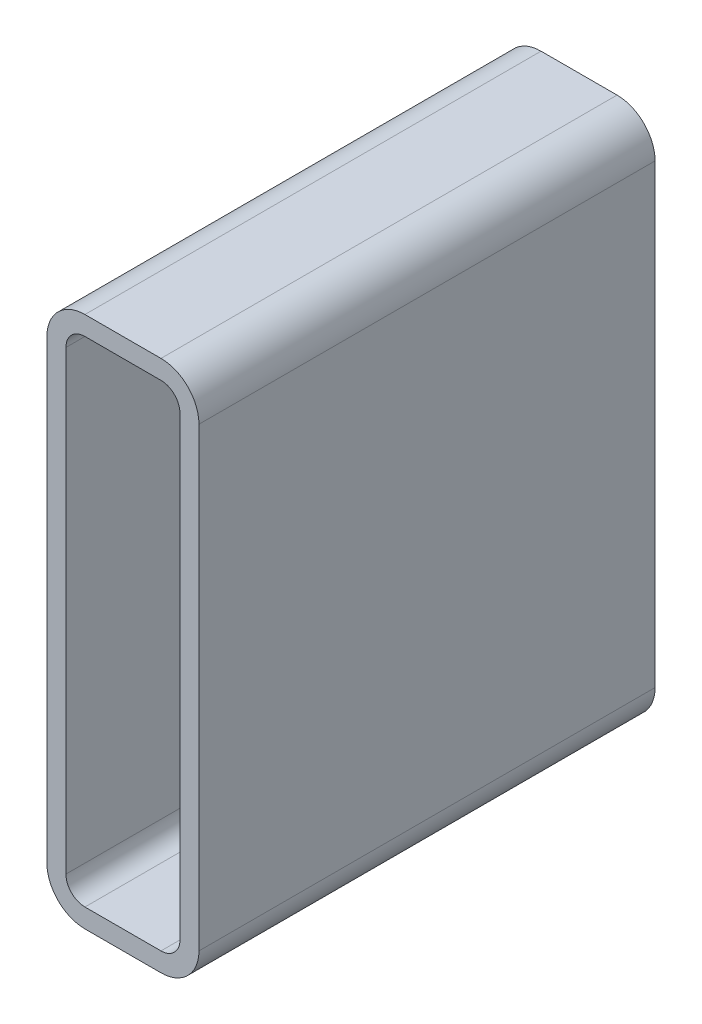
ISO-10303-21;
HEADER;
FILE_DESCRIPTION(('STEP AP214'),'2;1');
FILE_NAME('part.step','',(''),(''),'','','');
FILE_SCHEMA(('AUTOMOTIVE_DESIGN { 1 0 10303 214 1 1 1 1 }'));
ENDSEC;
DATA;
#1=APPLICATION_CONTEXT('core data for automotive mechanical design processes');
#2=APPLICATION_PROTOCOL_DEFINITION('international standard','automotive_design',2000,#1);
#3=PRODUCT_CONTEXT('',#1,'mechanical');
#4=PRODUCT('Part','Part','',(#3));
#5=PRODUCT_RELATED_PRODUCT_CATEGORY('part','',(#4));
#6=PRODUCT_DEFINITION_FORMATION('','',#4);
#7=PRODUCT_DEFINITION_CONTEXT('part definition',#1,'design');
#8=PRODUCT_DEFINITION('design','',#6,#7);
#9=PRODUCT_DEFINITION_SHAPE('','',#8);
#10=(LENGTH_UNIT() NAMED_UNIT(*) SI_UNIT(.MILLI.,.METRE.));
#11=(NAMED_UNIT(*) PLANE_ANGLE_UNIT() SI_UNIT($,.RADIAN.));
#12=(NAMED_UNIT(*) SI_UNIT($,.STERADIAN.) SOLID_ANGLE_UNIT());
#13=UNCERTAINTY_MEASURE_WITH_UNIT(LENGTH_MEASURE(1.E-05),#10,'distance_accuracy_value','');
#14=(GEOMETRIC_REPRESENTATION_CONTEXT(3) GLOBAL_UNCERTAINTY_ASSIGNED_CONTEXT((#13)) GLOBAL_UNIT_ASSIGNED_CONTEXT((#10,
#11,#12)) REPRESENTATION_CONTEXT('',''));
#15=CARTESIAN_POINT('',(0.,0.,0.));
#16=DIRECTION('',(0.,0.,1.));
#17=DIRECTION('',(1.,0.,0.));
#18=AXIS2_PLACEMENT_3D('',#15,#16,#17);
#19=CARTESIAN_POINT('',(27.0751778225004,332.028679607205,304.8));
#20=DIRECTION('',(0.,0.,1.));
#21=DIRECTION('',(1.,0.,0.));
#22=AXIS2_PLACEMENT_3D('',#19,#20,#21);
#23=PLANE('',#22);
#24=CARTESIAN_POINT('',(27.0751778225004,332.028679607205,304.8));
#25=DIRECTION('',(0.,0.,1.));
#26=DIRECTION('',(1.,0.,0.));
#27=AXIS2_PLACEMENT_3D('',#24,#25,#26);
#28=CIRCLE('',#27,25.4);
#29=CARTESIAN_POINT('',(27.0751778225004,357.428679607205,304.8));
#30=VERTEX_POINT('',#29);
#31=CARTESIAN_POINT('',(1.67517782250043,332.028679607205,304.8));
#32=VERTEX_POINT('',#31);
#33=EDGE_CURVE('E211',#30,#32,#28,.T.);
#34=ORIENTED_EDGE('',*,*,#33,.T.);
#35=DIRECTION('',(0.,-1.,0.));
#36=VECTOR('',#35,1.);
#37=CARTESIAN_POINT('',(1.67517782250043,27.2286796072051,304.8));
#38=LINE('',#37,#36);
#39=CARTESIAN_POINT('',(1.67517782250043,27.2286796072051,304.8));
#40=VERTEX_POINT('',#39);
#41=EDGE_CURVE('E214',#32,#40,#38,.T.);
#42=ORIENTED_EDGE('',*,*,#41,.T.);
#43=CARTESIAN_POINT('',(27.0751778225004,27.2286796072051,304.8));
#44=DIRECTION('',(0.,0.,1.));
#45=DIRECTION('',(1.,0.,0.));
#46=AXIS2_PLACEMENT_3D('',#43,#44,#45);
#47=CIRCLE('',#46,25.4);
#48=CARTESIAN_POINT('',(27.0751778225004,1.82867960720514,304.8));
#49=VERTEX_POINT('',#48);
#50=EDGE_CURVE('E217',#40,#49,#47,.T.);
#51=ORIENTED_EDGE('',*,*,#50,.T.);
#52=DIRECTION('',(1.,0.,0.));
#53=VECTOR('',#52,1.);
#54=CARTESIAN_POINT('',(77.8751778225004,1.82867960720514,304.8));
#55=LINE('',#54,#53);
#56=CARTESIAN_POINT('',(77.8751778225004,1.82867960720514,304.8));
#57=VERTEX_POINT('',#56);
#58=EDGE_CURVE('E219',#49,#57,#55,.T.);
#59=ORIENTED_EDGE('',*,*,#58,.T.);
#60=CARTESIAN_POINT('',(77.8751778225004,27.2286796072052,304.8));
#61=DIRECTION('',(0.,0.,1.));
#62=DIRECTION('',(1.,0.,0.));
#63=AXIS2_PLACEMENT_3D('',#60,#61,#62);
#64=CIRCLE('',#63,25.4);
#65=CARTESIAN_POINT('',(103.2751778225,27.2286796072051,304.8));
#66=VERTEX_POINT('',#65);
#67=EDGE_CURVE('E221',#57,#66,#64,.T.);
#68=ORIENTED_EDGE('',*,*,#67,.T.);
#69=DIRECTION('',(0.,1.,0.));
#70=VECTOR('',#69,1.);
#71=CARTESIAN_POINT('',(103.2751778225,332.028679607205,304.8));
#72=LINE('',#71,#70);
#73=CARTESIAN_POINT('',(103.2751778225,332.028679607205,304.8));
#74=VERTEX_POINT('',#73);
#75=EDGE_CURVE('E223',#66,#74,#72,.T.);
#76=ORIENTED_EDGE('',*,*,#75,.T.);
#77=CARTESIAN_POINT('',(77.8751778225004,332.028679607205,304.8));
#78=DIRECTION('',(0.,0.,1.));
#79=DIRECTION('',(1.,0.,0.));
#80=AXIS2_PLACEMENT_3D('',#77,#78,#79);
#81=CIRCLE('',#80,25.4);
#82=CARTESIAN_POINT('',(77.8751778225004,357.428679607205,304.8));
#83=VERTEX_POINT('',#82);
#84=EDGE_CURVE('E225',#74,#83,#81,.T.);
#85=ORIENTED_EDGE('',*,*,#84,.T.);
#86=DIRECTION('',(-1.,0.,0.));
#87=VECTOR('',#86,1.);
#88=CARTESIAN_POINT('',(27.0751778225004,357.428679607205,304.8));
#89=LINE('',#88,#87);
#90=EDGE_CURVE('E227',#83,#30,#89,.T.);
#91=ORIENTED_EDGE('',*,*,#90,.T.);
#92=EDGE_LOOP('',(#34,#42,#51,#59,#68,#76,#85,#91));
#93=FACE_BOUND('',#92,.T.);
#94=DIRECTION('',(0.,-1.,0.));
#95=VECTOR('',#94,1.);
#96=CARTESIAN_POINT('',(14.3751778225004,27.2286796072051,304.8));
#97=LINE('',#96,#95);
#98=CARTESIAN_POINT('',(14.3751778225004,332.028679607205,304.8));
#99=VERTEX_POINT('',#98);
#100=CARTESIAN_POINT('',(14.3751778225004,27.2286796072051,304.8));
#101=VERTEX_POINT('',#100);
#102=EDGE_CURVE('E154',#99,#101,#97,.T.);
#103=ORIENTED_EDGE('',*,*,#102,.F.);
#104=CARTESIAN_POINT('',(27.0751778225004,332.028679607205,304.8));
#105=DIRECTION('',(0.,0.,1.));
#106=DIRECTION('',(1.,0.,0.));
#107=AXIS2_PLACEMENT_3D('',#104,#105,#106);
#108=CIRCLE('',#107,12.7);
#109=CARTESIAN_POINT('',(27.0751778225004,344.728679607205,304.8));
#110=VERTEX_POINT('',#109);
#111=EDGE_CURVE('E146',#110,#99,#108,.T.);
#112=ORIENTED_EDGE('',*,*,#111,.F.);
#113=DIRECTION('',(-1.,0.,0.));
#114=VECTOR('',#113,1.);
#115=CARTESIAN_POINT('',(27.0751778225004,344.728679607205,304.8));
#116=LINE('',#115,#114);
#117=CARTESIAN_POINT('',(77.8751778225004,344.728679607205,304.8));
#118=VERTEX_POINT('',#117);
#119=EDGE_CURVE('E179',#118,#110,#116,.T.);
#120=ORIENTED_EDGE('',*,*,#119,.F.);
#121=CARTESIAN_POINT('',(77.8751778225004,332.028679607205,304.8));
#122=DIRECTION('',(0.,0.,1.));
#123=DIRECTION('',(1.,0.,0.));
#124=AXIS2_PLACEMENT_3D('',#121,#122,#123);
#125=CIRCLE('',#124,12.7);
#126=CARTESIAN_POINT('',(90.5751778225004,332.028679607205,304.8));
#127=VERTEX_POINT('',#126);
#128=EDGE_CURVE('E177',#127,#118,#125,.T.);
#129=ORIENTED_EDGE('',*,*,#128,.F.);
#130=DIRECTION('',(0.,1.,0.));
#131=VECTOR('',#130,1.);
#132=CARTESIAN_POINT('',(90.5751778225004,332.028679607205,304.8));
#133=LINE('',#132,#131);
#134=CARTESIAN_POINT('',(90.5751778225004,27.2286796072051,304.8));
#135=VERTEX_POINT('',#134);
#136=EDGE_CURVE('E175',#135,#127,#133,.T.);
#137=ORIENTED_EDGE('',*,*,#136,.F.);
#138=CARTESIAN_POINT('',(77.8751778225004,27.2286796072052,304.8));
#139=DIRECTION('',(0.,0.,1.));
#140=DIRECTION('',(1.,0.,0.));
#141=AXIS2_PLACEMENT_3D('',#138,#139,#140);
#142=CIRCLE('',#141,12.7);
#143=CARTESIAN_POINT('',(77.8751778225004,14.5286796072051,304.8));
#144=VERTEX_POINT('',#143);
#145=EDGE_CURVE('E173',#144,#135,#142,.T.);
#146=ORIENTED_EDGE('',*,*,#145,.F.);
#147=DIRECTION('',(1.,0.,0.));
#148=VECTOR('',#147,1.);
#149=CARTESIAN_POINT('',(77.8751778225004,14.5286796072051,304.8));
#150=LINE('',#149,#148);
#151=CARTESIAN_POINT('',(27.0751778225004,14.5286796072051,304.8));
#152=VERTEX_POINT('',#151);
#153=EDGE_CURVE('E169',#152,#144,#150,.T.);
#154=ORIENTED_EDGE('',*,*,#153,.F.);
#155=CARTESIAN_POINT('',(27.0751778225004,27.2286796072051,304.8));
#156=DIRECTION('',(0.,0.,1.));
#157=DIRECTION('',(1.,0.,0.));
#158=AXIS2_PLACEMENT_3D('',#155,#156,#157);
#159=CIRCLE('',#158,12.7);
#160=EDGE_CURVE('E167',#101,#152,#159,.T.);
#161=ORIENTED_EDGE('',*,*,#160,.F.);
#162=EDGE_LOOP('',(#103,#112,#120,#129,#137,#146,#154,#161));
#163=FACE_BOUND('',#162,.T.);
#164=ADVANCED_FACE('F33',(#93,#163),#23,.T.);
#165=CARTESIAN_POINT('',(27.0751778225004,332.028679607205,0.));
#166=DIRECTION('',(0.,0.,1.));
#167=DIRECTION('',(1.,0.,0.));
#168=AXIS2_PLACEMENT_3D('',#165,#166,#167);
#169=PLANE('',#168);
#170=CARTESIAN_POINT('',(27.0751778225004,332.028679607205,0.));
#171=DIRECTION('',(0.,0.,1.));
#172=DIRECTION('',(1.,0.,0.));
#173=AXIS2_PLACEMENT_3D('',#170,#171,#172);
#174=CIRCLE('',#173,25.4);
#175=CARTESIAN_POINT('',(27.0751778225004,357.428679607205,0.));
#176=VERTEX_POINT('',#175);
#177=CARTESIAN_POINT('',(1.67517782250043,332.028679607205,0.));
#178=VERTEX_POINT('',#177);
#179=EDGE_CURVE('E162',#176,#178,#174,.T.);
#180=ORIENTED_EDGE('',*,*,#179,.F.);
#181=DIRECTION('',(-1.,0.,0.));
#182=VECTOR('',#181,1.);
#183=CARTESIAN_POINT('',(27.0751778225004,357.428679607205,0.));
#184=LINE('',#183,#182);
#185=CARTESIAN_POINT('',(77.8751778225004,357.428679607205,0.));
#186=VERTEX_POINT('',#185);
#187=EDGE_CURVE('E215',#186,#176,#184,.T.);
#188=ORIENTED_EDGE('',*,*,#187,.F.);
#189=CARTESIAN_POINT('',(77.8751778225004,332.028679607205,0.));
#190=DIRECTION('',(0.,0.,1.));
#191=DIRECTION('',(1.,0.,0.));
#192=AXIS2_PLACEMENT_3D('',#189,#190,#191);
#193=CIRCLE('',#192,25.4);
#194=CARTESIAN_POINT('',(103.2751778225,332.028679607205,0.));
#195=VERTEX_POINT('',#194);
#196=EDGE_CURVE('E242',#195,#186,#193,.T.);
#197=ORIENTED_EDGE('',*,*,#196,.F.);
#198=DIRECTION('',(0.,1.,0.));
#199=VECTOR('',#198,1.);
#200=CARTESIAN_POINT('',(103.2751778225,332.028679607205,0.));
#201=LINE('',#200,#199);
#202=CARTESIAN_POINT('',(103.2751778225,27.2286796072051,0.));
#203=VERTEX_POINT('',#202);
#204=EDGE_CURVE('E240',#203,#195,#201,.T.);
#205=ORIENTED_EDGE('',*,*,#204,.F.);
#206=CARTESIAN_POINT('',(77.8751778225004,27.2286796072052,0.));
#207=DIRECTION('',(0.,0.,1.));
#208=DIRECTION('',(1.,0.,0.));
#209=AXIS2_PLACEMENT_3D('',#206,#207,#208);
#210=CIRCLE('',#209,25.4);
#211=CARTESIAN_POINT('',(77.8751778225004,1.82867960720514,0.));
#212=VERTEX_POINT('',#211);
#213=EDGE_CURVE('E238',#212,#203,#210,.T.);
#214=ORIENTED_EDGE('',*,*,#213,.F.);
#215=DIRECTION('',(1.,0.,0.));
#216=VECTOR('',#215,1.);
#217=CARTESIAN_POINT('',(77.8751778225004,1.82867960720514,0.));
#218=LINE('',#217,#216);
#219=CARTESIAN_POINT('',(27.0751778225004,1.82867960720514,0.));
#220=VERTEX_POINT('',#219);
#221=EDGE_CURVE('E236',#220,#212,#218,.T.);
#222=ORIENTED_EDGE('',*,*,#221,.F.);
#223=CARTESIAN_POINT('',(27.0751778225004,27.2286796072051,0.));
#224=DIRECTION('',(0.,0.,1.));
#225=DIRECTION('',(1.,0.,0.));
#226=AXIS2_PLACEMENT_3D('',#223,#224,#225);
#227=CIRCLE('',#226,25.4);
#228=CARTESIAN_POINT('',(1.67517782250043,27.2286796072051,0.));
#229=VERTEX_POINT('',#228);
#230=EDGE_CURVE('E234',#229,#220,#227,.T.);
#231=ORIENTED_EDGE('',*,*,#230,.F.);
#232=DIRECTION('',(0.,-1.,0.));
#233=VECTOR('',#232,1.);
#234=CARTESIAN_POINT('',(1.67517782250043,27.2286796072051,0.));
#235=LINE('',#234,#233);
#236=EDGE_CURVE('E232',#178,#229,#235,.T.);
#237=ORIENTED_EDGE('',*,*,#236,.F.);
#238=EDGE_LOOP('',(#180,#188,#197,#205,#214,#222,#231,#237));
#239=FACE_BOUND('',#238,.T.);
#240=CARTESIAN_POINT('',(27.0751778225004,332.028679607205,0.));
#241=DIRECTION('',(0.,0.,1.));
#242=DIRECTION('',(1.,0.,0.));
#243=AXIS2_PLACEMENT_3D('',#240,#241,#242);
#244=CIRCLE('',#243,12.7);
#245=CARTESIAN_POINT('',(27.0751778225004,344.728679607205,0.));
#246=VERTEX_POINT('',#245);
#247=CARTESIAN_POINT('',(14.3751778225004,332.028679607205,0.));
#248=VERTEX_POINT('',#247);
#249=EDGE_CURVE('E56',#246,#248,#244,.T.);
#250=ORIENTED_EDGE('',*,*,#249,.T.);
#251=DIRECTION('',(0.,-1.,0.));
#252=VECTOR('',#251,1.);
#253=CARTESIAN_POINT('',(14.3751778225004,27.2286796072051,0.));
#254=LINE('',#253,#252);
#255=CARTESIAN_POINT('',(14.3751778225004,27.2286796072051,0.));
#256=VERTEX_POINT('',#255);
#257=EDGE_CURVE('E161',#248,#256,#254,.T.);
#258=ORIENTED_EDGE('',*,*,#257,.T.);
#259=CARTESIAN_POINT('',(27.0751778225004,27.2286796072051,0.));
#260=DIRECTION('',(0.,0.,1.));
#261=DIRECTION('',(1.,0.,0.));
#262=AXIS2_PLACEMENT_3D('',#259,#260,#261);
#263=CIRCLE('',#262,12.7);
#264=CARTESIAN_POINT('',(27.0751778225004,14.5286796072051,0.));
#265=VERTEX_POINT('',#264);
#266=EDGE_CURVE('E183',#256,#265,#263,.T.);
#267=ORIENTED_EDGE('',*,*,#266,.T.);
#268=DIRECTION('',(1.,0.,0.));
#269=VECTOR('',#268,1.);
#270=CARTESIAN_POINT('',(77.8751778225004,14.5286796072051,0.));
#271=LINE('',#270,#269);
#272=CARTESIAN_POINT('',(77.8751778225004,14.5286796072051,0.));
#273=VERTEX_POINT('',#272);
#274=EDGE_CURVE('E186',#265,#273,#271,.T.);
#275=ORIENTED_EDGE('',*,*,#274,.T.);
#276=CARTESIAN_POINT('',(77.8751778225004,27.2286796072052,0.));
#277=DIRECTION('',(0.,0.,1.));
#278=DIRECTION('',(1.,0.,0.));
#279=AXIS2_PLACEMENT_3D('',#276,#277,#278);
#280=CIRCLE('',#279,12.7);
#281=CARTESIAN_POINT('',(90.5751778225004,27.2286796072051,0.));
#282=VERTEX_POINT('',#281);
#283=EDGE_CURVE('E189',#273,#282,#280,.T.);
#284=ORIENTED_EDGE('',*,*,#283,.T.);
#285=DIRECTION('',(0.,1.,0.));
#286=VECTOR('',#285,1.);
#287=CARTESIAN_POINT('',(90.5751778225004,332.028679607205,0.));
#288=LINE('',#287,#286);
#289=CARTESIAN_POINT('',(90.5751778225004,332.028679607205,0.));
#290=VERTEX_POINT('',#289);
#291=EDGE_CURVE('E192',#282,#290,#288,.T.);
#292=ORIENTED_EDGE('',*,*,#291,.T.);
#293=CARTESIAN_POINT('',(77.8751778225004,332.028679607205,0.));
#294=DIRECTION('',(0.,0.,1.));
#295=DIRECTION('',(1.,0.,0.));
#296=AXIS2_PLACEMENT_3D('',#293,#294,#295);
#297=CIRCLE('',#296,12.7);
#298=CARTESIAN_POINT('',(77.8751778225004,344.728679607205,0.));
#299=VERTEX_POINT('',#298);
#300=EDGE_CURVE('E195',#290,#299,#297,.T.);
#301=ORIENTED_EDGE('',*,*,#300,.T.);
#302=DIRECTION('',(-1.,0.,0.));
#303=VECTOR('',#302,1.);
#304=CARTESIAN_POINT('',(27.0751778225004,344.728679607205,0.));
#305=LINE('',#304,#303);
#306=EDGE_CURVE('E155',#299,#246,#305,.T.);
#307=ORIENTED_EDGE('',*,*,#306,.T.);
#308=EDGE_LOOP('',(#250,#258,#267,#275,#284,#292,#301,#307));
#309=FACE_BOUND('',#308,.T.);
#310=ADVANCED_FACE('F272',(#239,#309),#169,.F.);
#311=CARTESIAN_POINT('',(27.0751778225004,332.028679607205,304.8));
#312=DIRECTION('',(0.,0.,-1.));
#313=DIRECTION('',(-1.,0.,0.));
#314=AXIS2_PLACEMENT_3D('',#311,#312,#313);
#315=CYLINDRICAL_SURFACE('',#314,25.4);
#316=ORIENTED_EDGE('',*,*,#179,.T.);
#317=DIRECTION('',(0.,0.,-1.));
#318=VECTOR('',#317,1.);
#319=CARTESIAN_POINT('',(1.67517782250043,332.028679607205,304.8));
#320=LINE('',#319,#318);
#321=EDGE_CURVE('E11',#32,#178,#320,.T.);
#322=ORIENTED_EDGE('',*,*,#321,.F.);
#323=ORIENTED_EDGE('',*,*,#33,.F.);
#324=DIRECTION('',(0.,0.,-1.));
#325=VECTOR('',#324,1.);
#326=CARTESIAN_POINT('',(27.0751778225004,357.428679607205,304.8));
#327=LINE('',#326,#325);
#328=EDGE_CURVE('E229',#30,#176,#327,.T.);
#329=ORIENTED_EDGE('',*,*,#328,.T.);
#330=EDGE_LOOP('',(#316,#322,#323,#329));
#331=FACE_BOUND('',#330,.T.);
#332=ADVANCED_FACE('F35',(#331),#315,.T.);
#333=CARTESIAN_POINT('',(1.67517782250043,27.2286796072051,304.8));
#334=DIRECTION('',(1.,0.,0.));
#335=DIRECTION('',(0.,0.,-1.));
#336=AXIS2_PLACEMENT_3D('',#333,#334,#335);
#337=PLANE('',#336);
#338=ORIENTED_EDGE('',*,*,#236,.T.);
#339=DIRECTION('',(0.,0.,-1.));
#340=VECTOR('',#339,1.);
#341=CARTESIAN_POINT('',(1.67517782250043,27.2286796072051,304.8));
#342=LINE('',#341,#340);
#343=EDGE_CURVE('E41',#40,#229,#342,.T.);
#344=ORIENTED_EDGE('',*,*,#343,.F.);
#345=ORIENTED_EDGE('',*,*,#41,.F.);
#346=ORIENTED_EDGE('',*,*,#321,.T.);
#347=EDGE_LOOP('',(#338,#344,#345,#346));
#348=FACE_BOUND('',#347,.T.);
#349=ADVANCED_FACE('F289',(#348),#337,.F.);
#350=CARTESIAN_POINT('',(27.0751778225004,27.2286796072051,304.8));
#351=DIRECTION('',(0.,0.,-1.));
#352=DIRECTION('',(-1.,0.,0.));
#353=AXIS2_PLACEMENT_3D('',#350,#351,#352);
#354=CYLINDRICAL_SURFACE('',#353,25.4);
#355=ORIENTED_EDGE('',*,*,#230,.T.);
#356=DIRECTION('',(0.,0.,-1.));
#357=VECTOR('',#356,1.);
#358=CARTESIAN_POINT('',(27.0751778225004,1.82867960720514,304.8));
#359=LINE('',#358,#357);
#360=EDGE_CURVE('E259',#49,#220,#359,.T.);
#361=ORIENTED_EDGE('',*,*,#360,.F.);
#362=ORIENTED_EDGE('',*,*,#50,.F.);
#363=ORIENTED_EDGE('',*,*,#343,.T.);
#364=EDGE_LOOP('',(#355,#361,#362,#363));
#365=FACE_BOUND('',#364,.T.);
#366=ADVANCED_FACE('F266',(#365),#354,.T.);
#367=CARTESIAN_POINT('',(77.8751778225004,1.82867960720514,304.8));
#368=DIRECTION('',(0.,1.,0.));
#369=DIRECTION('',(0.,0.,1.));
#370=AXIS2_PLACEMENT_3D('',#367,#368,#369);
#371=PLANE('',#370);
#372=ORIENTED_EDGE('',*,*,#221,.T.);
#373=DIRECTION('',(0.,0.,-1.));
#374=VECTOR('',#373,1.);
#375=CARTESIAN_POINT('',(77.8751778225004,1.82867960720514,304.8));
#376=LINE('',#375,#374);
#377=EDGE_CURVE('E256',#57,#212,#376,.T.);
#378=ORIENTED_EDGE('',*,*,#377,.F.);
#379=ORIENTED_EDGE('',*,*,#58,.F.);
#380=ORIENTED_EDGE('',*,*,#360,.T.);
#381=EDGE_LOOP('',(#372,#378,#379,#380));
#382=FACE_BOUND('',#381,.T.);
#383=ADVANCED_FACE('F278',(#382),#371,.F.);
#384=CARTESIAN_POINT('',(77.8751778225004,27.2286796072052,304.8));
#385=DIRECTION('',(0.,0.,-1.));
#386=DIRECTION('',(-1.,0.,0.));
#387=AXIS2_PLACEMENT_3D('',#384,#385,#386);
#388=CYLINDRICAL_SURFACE('',#387,25.4);
#389=ORIENTED_EDGE('',*,*,#213,.T.);
#390=DIRECTION('',(0.,0.,-1.));
#391=VECTOR('',#390,1.);
#392=CARTESIAN_POINT('',(103.2751778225,27.2286796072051,304.8));
#393=LINE('',#392,#391);
#394=EDGE_CURVE('E253',#66,#203,#393,.T.);
#395=ORIENTED_EDGE('',*,*,#394,.F.);
#396=ORIENTED_EDGE('',*,*,#67,.F.);
#397=ORIENTED_EDGE('',*,*,#377,.T.);
#398=EDGE_LOOP('',(#389,#395,#396,#397));
#399=FACE_BOUND('',#398,.T.);
#400=ADVANCED_FACE('F282',(#399),#388,.T.);
#401=CARTESIAN_POINT('',(103.2751778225,332.028679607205,304.8));
#402=DIRECTION('',(-1.,0.,0.));
#403=DIRECTION('',(0.,0.,1.));
#404=AXIS2_PLACEMENT_3D('',#401,#402,#403);
#405=PLANE('',#404);
#406=ORIENTED_EDGE('',*,*,#204,.T.);
#407=DIRECTION('',(0.,0.,-1.));
#408=VECTOR('',#407,1.);
#409=CARTESIAN_POINT('',(103.2751778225,332.028679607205,304.8));
#410=LINE('',#409,#408);
#411=EDGE_CURVE('E250',#74,#195,#410,.T.);
#412=ORIENTED_EDGE('',*,*,#411,.F.);
#413=ORIENTED_EDGE('',*,*,#75,.F.);
#414=ORIENTED_EDGE('',*,*,#394,.T.);
#415=EDGE_LOOP('',(#406,#412,#413,#414));
#416=FACE_BOUND('',#415,.T.);
#417=ADVANCED_FACE('F302',(#416),#405,.F.);
#418=CARTESIAN_POINT('',(77.8751778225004,332.028679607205,304.8));
#419=DIRECTION('',(0.,0.,-1.));
#420=DIRECTION('',(-1.,0.,0.));
#421=AXIS2_PLACEMENT_3D('',#418,#419,#420);
#422=CYLINDRICAL_SURFACE('',#421,25.4);
#423=ORIENTED_EDGE('',*,*,#196,.T.);
#424=DIRECTION('',(0.,0.,-1.));
#425=VECTOR('',#424,1.);
#426=CARTESIAN_POINT('',(77.8751778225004,357.428679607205,304.8));
#427=LINE('',#426,#425);
#428=EDGE_CURVE('E247',#83,#186,#427,.T.);
#429=ORIENTED_EDGE('',*,*,#428,.F.);
#430=ORIENTED_EDGE('',*,*,#84,.F.);
#431=ORIENTED_EDGE('',*,*,#411,.T.);
#432=EDGE_LOOP('',(#423,#429,#430,#431));
#433=FACE_BOUND('',#432,.T.);
#434=ADVANCED_FACE('F300',(#433),#422,.T.);
#435=CARTESIAN_POINT('',(27.0751778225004,357.428679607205,304.8));
#436=DIRECTION('',(0.,-1.,0.));
#437=DIRECTION('',(0.,0.,-1.));
#438=AXIS2_PLACEMENT_3D('',#435,#436,#437);
#439=PLANE('',#438);
#440=ORIENTED_EDGE('',*,*,#187,.T.);
#441=ORIENTED_EDGE('',*,*,#328,.F.);
#442=ORIENTED_EDGE('',*,*,#90,.F.);
#443=ORIENTED_EDGE('',*,*,#428,.T.);
#444=EDGE_LOOP('',(#440,#441,#442,#443));
#445=FACE_BOUND('',#444,.T.);
#446=ADVANCED_FACE('F295',(#445),#439,.F.);
#447=CARTESIAN_POINT('',(27.0751778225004,332.028679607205,304.8));
#448=DIRECTION('',(0.,0.,-1.));
#449=DIRECTION('',(-1.,0.,0.));
#450=AXIS2_PLACEMENT_3D('',#447,#448,#449);
#451=CYLINDRICAL_SURFACE('',#450,12.7);
#452=ORIENTED_EDGE('',*,*,#249,.F.);
#453=DIRECTION('',(0.,0.,-1.));
#454=VECTOR('',#453,1.);
#455=CARTESIAN_POINT('',(27.0751778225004,344.728679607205,304.8));
#456=LINE('',#455,#454);
#457=EDGE_CURVE('E150',#110,#246,#456,.T.);
#458=ORIENTED_EDGE('',*,*,#457,.F.);
#459=ORIENTED_EDGE('',*,*,#111,.T.);
#460=DIRECTION('',(0.,0.,-1.));
#461=VECTOR('',#460,1.);
#462=CARTESIAN_POINT('',(14.3751778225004,332.028679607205,304.8));
#463=LINE('',#462,#461);
#464=EDGE_CURVE('E149',#99,#248,#463,.T.);
#465=ORIENTED_EDGE('',*,*,#464,.T.);
#466=EDGE_LOOP('',(#452,#458,#459,#465));
#467=FACE_BOUND('',#466,.T.);
#468=ADVANCED_FACE('F148',(#467),#451,.F.);
#469=CARTESIAN_POINT('',(14.3751778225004,27.2286796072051,304.8));
#470=DIRECTION('',(1.,0.,0.));
#471=DIRECTION('',(0.,0.,-1.));
#472=AXIS2_PLACEMENT_3D('',#469,#470,#471);
#473=PLANE('',#472);
#474=ORIENTED_EDGE('',*,*,#257,.F.);
#475=ORIENTED_EDGE('',*,*,#464,.F.);
#476=ORIENTED_EDGE('',*,*,#102,.T.);
#477=DIRECTION('',(0.,0.,-1.));
#478=VECTOR('',#477,1.);
#479=CARTESIAN_POINT('',(14.3751778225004,27.2286796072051,304.8));
#480=LINE('',#479,#478);
#481=EDGE_CURVE('E163',#101,#256,#480,.T.);
#482=ORIENTED_EDGE('',*,*,#481,.T.);
#483=EDGE_LOOP('',(#474,#475,#476,#482));
#484=FACE_BOUND('',#483,.T.);
#485=ADVANCED_FACE('F158',(#484),#473,.T.);
#486=CARTESIAN_POINT('',(27.0751778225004,27.2286796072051,304.8));
#487=DIRECTION('',(0.,0.,-1.));
#488=DIRECTION('',(-1.,0.,0.));
#489=AXIS2_PLACEMENT_3D('',#486,#487,#488);
#490=CYLINDRICAL_SURFACE('',#489,12.7);
#491=ORIENTED_EDGE('',*,*,#266,.F.);
#492=ORIENTED_EDGE('',*,*,#481,.F.);
#493=ORIENTED_EDGE('',*,*,#160,.T.);
#494=DIRECTION('',(0.,0.,-1.));
#495=VECTOR('',#494,1.);
#496=CARTESIAN_POINT('',(27.0751778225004,14.5286796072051,304.8));
#497=LINE('',#496,#495);
#498=EDGE_CURVE('E208',#152,#265,#497,.T.);
#499=ORIENTED_EDGE('',*,*,#498,.T.);
#500=EDGE_LOOP('',(#491,#492,#493,#499));
#501=FACE_BOUND('',#500,.T.);
#502=ADVANCED_FACE('F327',(#501),#490,.F.);
#503=CARTESIAN_POINT('',(77.8751778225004,14.5286796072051,304.8));
#504=DIRECTION('',(0.,1.,0.));
#505=DIRECTION('',(0.,0.,1.));
#506=AXIS2_PLACEMENT_3D('',#503,#504,#505);
#507=PLANE('',#506);
#508=ORIENTED_EDGE('',*,*,#274,.F.);
#509=ORIENTED_EDGE('',*,*,#498,.F.);
#510=ORIENTED_EDGE('',*,*,#153,.T.);
#511=DIRECTION('',(0.,0.,-1.));
#512=VECTOR('',#511,1.);
#513=CARTESIAN_POINT('',(77.8751778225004,14.5286796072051,304.8));
#514=LINE('',#513,#512);
#515=EDGE_CURVE('E206',#144,#273,#514,.T.);
#516=ORIENTED_EDGE('',*,*,#515,.T.);
#517=EDGE_LOOP('',(#508,#509,#510,#516));
#518=FACE_BOUND('',#517,.T.);
#519=ADVANCED_FACE('F331',(#518),#507,.T.);
#520=CARTESIAN_POINT('',(77.8751778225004,27.2286796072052,304.8));
#521=DIRECTION('',(0.,0.,-1.));
#522=DIRECTION('',(-1.,0.,0.));
#523=AXIS2_PLACEMENT_3D('',#520,#521,#522);
#524=CYLINDRICAL_SURFACE('',#523,12.7);
#525=ORIENTED_EDGE('',*,*,#283,.F.);
#526=ORIENTED_EDGE('',*,*,#515,.F.);
#527=ORIENTED_EDGE('',*,*,#145,.T.);
#528=DIRECTION('',(0.,0.,-1.));
#529=VECTOR('',#528,1.);
#530=CARTESIAN_POINT('',(90.5751778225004,27.2286796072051,304.8));
#531=LINE('',#530,#529);
#532=EDGE_CURVE('E204',#135,#282,#531,.T.);
#533=ORIENTED_EDGE('',*,*,#532,.T.);
#534=EDGE_LOOP('',(#525,#526,#527,#533));
#535=FACE_BOUND('',#534,.T.);
#536=ADVANCED_FACE('F337',(#535),#524,.F.);
#537=CARTESIAN_POINT('',(90.5751778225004,332.028679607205,304.8));
#538=DIRECTION('',(-1.,0.,0.));
#539=DIRECTION('',(0.,0.,1.));
#540=AXIS2_PLACEMENT_3D('',#537,#538,#539);
#541=PLANE('',#540);
#542=ORIENTED_EDGE('',*,*,#291,.F.);
#543=ORIENTED_EDGE('',*,*,#532,.F.);
#544=ORIENTED_EDGE('',*,*,#136,.T.);
#545=DIRECTION('',(0.,0.,-1.));
#546=VECTOR('',#545,1.);
#547=CARTESIAN_POINT('',(90.5751778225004,332.028679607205,304.8));
#548=LINE('',#547,#546);
#549=EDGE_CURVE('E202',#127,#290,#548,.T.);
#550=ORIENTED_EDGE('',*,*,#549,.T.);
#551=EDGE_LOOP('',(#542,#543,#544,#550));
#552=FACE_BOUND('',#551,.T.);
#553=ADVANCED_FACE('F341',(#552),#541,.T.);
#554=CARTESIAN_POINT('',(77.8751778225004,332.028679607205,304.8));
#555=DIRECTION('',(0.,0.,-1.));
#556=DIRECTION('',(-1.,0.,0.));
#557=AXIS2_PLACEMENT_3D('',#554,#555,#556);
#558=CYLINDRICAL_SURFACE('',#557,12.7);
#559=ORIENTED_EDGE('',*,*,#300,.F.);
#560=ORIENTED_EDGE('',*,*,#549,.F.);
#561=ORIENTED_EDGE('',*,*,#128,.T.);
#562=DIRECTION('',(0.,0.,-1.));
#563=VECTOR('',#562,1.);
#564=CARTESIAN_POINT('',(77.8751778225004,344.728679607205,304.8));
#565=LINE('',#564,#563);
#566=EDGE_CURVE('E48',#118,#299,#565,.T.);
#567=ORIENTED_EDGE('',*,*,#566,.T.);
#568=EDGE_LOOP('',(#559,#560,#561,#567));
#569=FACE_BOUND('',#568,.T.);
#570=ADVANCED_FACE('F345',(#569),#558,.F.);
#571=CARTESIAN_POINT('',(27.0751778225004,344.728679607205,304.8));
#572=DIRECTION('',(0.,-1.,0.));
#573=DIRECTION('',(0.,0.,-1.));
#574=AXIS2_PLACEMENT_3D('',#571,#572,#573);
#575=PLANE('',#574);
#576=ORIENTED_EDGE('',*,*,#306,.F.);
#577=ORIENTED_EDGE('',*,*,#566,.F.);
#578=ORIENTED_EDGE('',*,*,#119,.T.);
#579=ORIENTED_EDGE('',*,*,#457,.T.);
#580=EDGE_LOOP('',(#576,#577,#578,#579));
#581=FACE_BOUND('',#580,.T.);
#582=ADVANCED_FACE('F349',(#581),#575,.T.);
#583=CLOSED_SHELL('',(#164,#310,#332,#349,#366,#383,#400,#417,#434,#446,#468,#485,#502,#519,
#536,#553,#570,#582));
#584=MANIFOLD_SOLID_BREP('B2',#583);
#585=ADVANCED_BREP_SHAPE_REPRESENTATION('',(#18,#584),#14);
#586=SHAPE_DEFINITION_REPRESENTATION(#9,#585);
ENDSEC;
END-ISO-10303-21;
